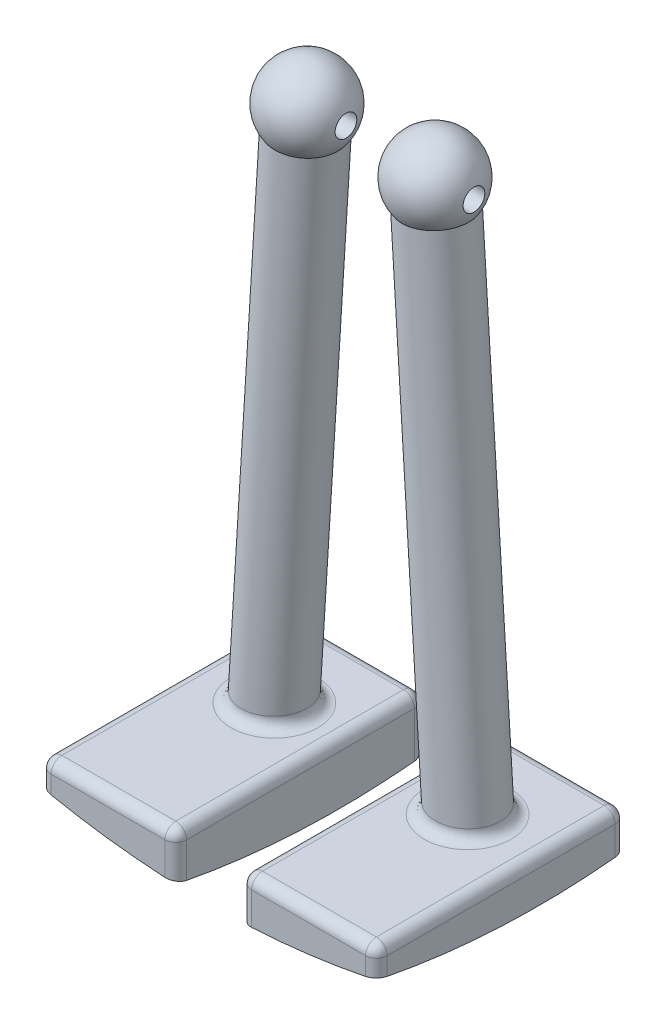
from build123d import *

# Parameters (mm, degrees)
SKETCH3_W          = 107.235310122
SKETCH3_H          = 199.649479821
CUT_EXTRUDE1_DEPTH = 208.460447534
SKETCH4_W          = 33.156143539
SKETCH4_H          = 23.267469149
CUT_EXTRUDE2_DEPTH = 108.581402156
SKETCH5_W          = 39.984782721
SKETCH5_H          = 17.306846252
CUT_EXTRUDE3_DEPTH = 102.48285434
FILLET1_R          = 1.27
SKETCH10_W         = 13.730364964
SKETCH10_H         = 1.27


with BuildPart() as part:
    # Sketch2 → Revolve1 (revolve)
    with BuildSketch(Plane.XY):
        with BuildLine():
            Line((3.81, -95.173769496), (3.81, -88.113686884))
            Line((3.81, -88.113686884), (19.685, -88.113686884))
            Line((19.685, -88.113686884), (19.685, -93.193686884))
            ThreePointArc((19.685, -93.193686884), (11.789144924, -94.517609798), (3.81, -95.173769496))
        make_face()
    revolve(axis=Axis((104.775, 0, 0), (-1, 0, 0)))

    # Sketch3 → Cut-Extrude1 (cut, through all)
    with BuildSketch(Plane(origin=(0, -88.113686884, 0), x_dir=(-1, 0, 0), z_dir=(0, 1, 0))):
        with Locations((-15.257056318, -0.290610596)):
            Rectangle(SKETCH3_W, SKETCH3_H)
    extrude(amount=CUT_EXTRUDE1_DEPTH, mode=Mode.SUBTRACT)

    # Sketch4 → Cut-Extrude2 (cut, through all)
    with BuildSketch(Plane.XY.offset(-10.16)):
        with Locations((11.342891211, -88.561804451)):
            Rectangle(SKETCH4_W, SKETCH4_H)
    extrude(amount=-CUT_EXTRUDE2_DEPTH, mode=Mode.SUBTRACT)

    # Sketch5 → Cut-Extrude3 (cut, through all)
    with BuildSketch(Plane.XY.offset(19.05)):
        with Locations((12.234149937, -91.244955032)):
            Rectangle(SKETCH5_W, SKETCH5_H)
    extrude(amount=CUT_EXTRUDE3_DEPTH, mode=Mode.SUBTRACT)

    # Sketch9 → Revolve3 (revolve)
    with BuildSketch(Plane.XY):
        with BuildLine():
            Line((11.405982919, -88.349924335), (7.201302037, -20.667980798))
            ThreePointArc((7.201302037, -20.667980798), (11.589059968, -23.008484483), (11.472905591, -27.980092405))
            Line((11.472905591, -27.980092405), (15.208651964, -88.113686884))
            Line((15.208651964, -88.113686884), (11.405982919, -88.349924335))
        make_face()
    revolve(axis=Axis((11.405982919, -88.349924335, 0), (-0.06200458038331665, 0.9980758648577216, 0)))

    # Fillet1
    fillet1_edges = [part.edges().sort_by_distance(p)[0] for p in [
        (3.81, -88.113686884, 4.445),
        (11.7475, -88.113686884, -10.16),
        (3.81, -91.371800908, -10.16),
        (19.685, -90.375947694, -10.16),
        (19.685, -88.113686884, 4.445),
        (11.7475, -88.113686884, 19.05),
        (3.81, -90.680721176, 19.05),
        (19.685, -89.669782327, 19.05),
        (7.573961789, -88.113686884, -3e-09),
    ]]
    fillet(fillet1_edges, radius=FILLET1_R)

    # Sketch10 → Cut-Revolve1 (revolve, cut)
    with BuildSketch(Plane.XY, mode=Mode.PRIVATE) as cut_revolve1_sk:
        with Locations((8.343469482, -24.765)):
            Rectangle(SKETCH10_W, SKETCH10_H)
    revolve(cut_revolve1_sk.sketch.rotate(Axis((1.478287, -25.4, 0), (1, 0, 0)), 90), axis=Axis((1.478287, -25.4, 0), (1, 0, 0)), mode=Mode.SUBTRACT)


with BuildPart() as body_2:
    # Mirror4: mirrored copy
    add(part.part.mirror(Plane(origin=(0, 0, 0), x_dir=(0, 0, 1), z_dir=(1, 0, 0))))


solid = Compound([part.part, body_2.part])
